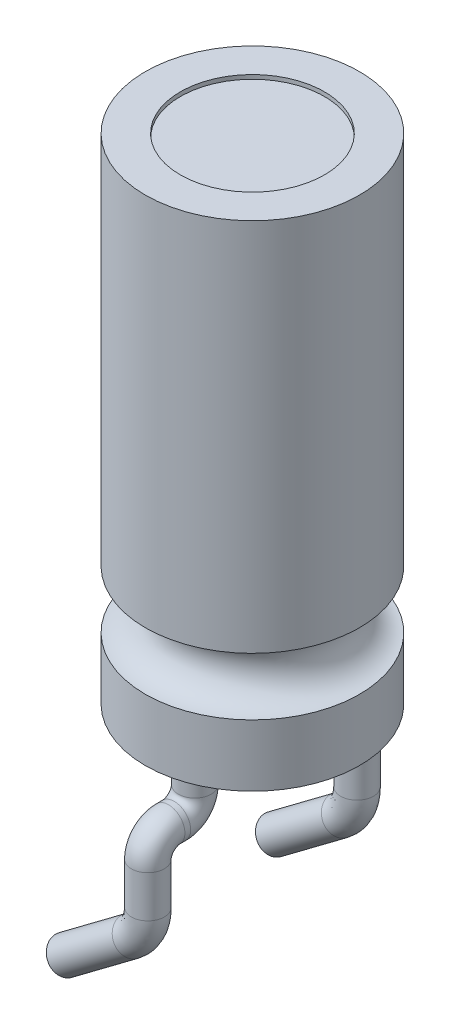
ISO-10303-21;
HEADER;
FILE_DESCRIPTION(('STEP AP214'),'2;1');
FILE_NAME('part.step','',(''),(''),'','','');
FILE_SCHEMA(('AUTOMOTIVE_DESIGN { 1 0 10303 214 1 1 1 1 }'));
ENDSEC;
DATA;
#1=APPLICATION_CONTEXT('core data for automotive mechanical design processes');
#2=APPLICATION_PROTOCOL_DEFINITION('international standard','automotive_design',2000,#1);
#3=PRODUCT_CONTEXT('',#1,'mechanical');
#4=PRODUCT('Part','Part','',(#3));
#5=PRODUCT_RELATED_PRODUCT_CATEGORY('part','',(#4));
#6=PRODUCT_DEFINITION_FORMATION('','',#4);
#7=PRODUCT_DEFINITION_CONTEXT('part definition',#1,'design');
#8=PRODUCT_DEFINITION('design','',#6,#7);
#9=PRODUCT_DEFINITION_SHAPE('','',#8);
#10=(LENGTH_UNIT() NAMED_UNIT(*) SI_UNIT(.MILLI.,.METRE.));
#11=(NAMED_UNIT(*) PLANE_ANGLE_UNIT() SI_UNIT($,.RADIAN.));
#12=(NAMED_UNIT(*) SI_UNIT($,.STERADIAN.) SOLID_ANGLE_UNIT());
#13=UNCERTAINTY_MEASURE_WITH_UNIT(LENGTH_MEASURE(1.E-05),#10,'distance_accuracy_value','');
#14=(GEOMETRIC_REPRESENTATION_CONTEXT(3) GLOBAL_UNCERTAINTY_ASSIGNED_CONTEXT((#13)) GLOBAL_UNIT_ASSIGNED_CONTEXT((#10,
#11,#12)) REPRESENTATION_CONTEXT('',''));
#15=CARTESIAN_POINT('',(0.,0.,0.));
#16=DIRECTION('',(0.,0.,1.));
#17=DIRECTION('',(1.,0.,0.));
#18=AXIS2_PLACEMENT_3D('',#15,#16,#17);
#19=CARTESIAN_POINT('',(2.6,27.5164236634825,0.));
#20=DIRECTION('',(0.,1.,0.));
#21=DIRECTION('',(0.,0.,1.));
#22=AXIS2_PLACEMENT_3D('',#19,#20,#21);
#23=PLANE('',#22);
#24=CARTESIAN_POINT('',(0.,27.5164236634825,-1.4));
#25=DIRECTION('',(0.,1.,0.));
#26=DIRECTION('',(0.,0.,1.));
#27=AXIS2_PLACEMENT_3D('',#24,#25,#26);
#28=CIRCLE('',#27,0.4);
#29=CARTESIAN_POINT('',(0.,27.5164236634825,-1.));
#30=VERTEX_POINT('',#29);
#31=EDGE_CURVE('E137',#30,#30,#28,.T.);
#32=ORIENTED_EDGE('',*,*,#31,.T.);
#33=EDGE_LOOP('',(#32));
#34=FACE_BOUND('',#33,.T.);
#35=CARTESIAN_POINT('',(0.,27.5164236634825,0.));
#36=DIRECTION('',(0.,1.,0.));
#37=DIRECTION('',(0.,0.,1.));
#38=AXIS2_PLACEMENT_3D('',#35,#36,#37);
#39=CIRCLE('',#38,2.6);
#40=CARTESIAN_POINT('',(0.,27.5164236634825,2.6));
#41=VERTEX_POINT('',#40);
#42=EDGE_CURVE('E36',#41,#41,#39,.T.);
#43=ORIENTED_EDGE('',*,*,#42,.F.);
#44=EDGE_LOOP('',(#43));
#45=FACE_BOUND('',#44,.T.);
#46=CARTESIAN_POINT('',(0.,27.5164236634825,1.4));
#47=DIRECTION('',(0.,1.,0.));
#48=DIRECTION('',(0.,0.,1.));
#49=AXIS2_PLACEMENT_3D('',#46,#47,#48);
#50=CIRCLE('',#49,0.4);
#51=CARTESIAN_POINT('',(0.,27.5164236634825,1.8));
#52=VERTEX_POINT('',#51);
#53=EDGE_CURVE('E10',#52,#52,#50,.F.);
#54=ORIENTED_EDGE('',*,*,#53,.F.);
#55=EDGE_LOOP('',(#54));
#56=FACE_BOUND('',#55,.T.);
#57=ADVANCED_FACE('F30',(#34,#45,#56),#23,.F.);
#58=CARTESIAN_POINT('',(0.,48.4017094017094,0.));
#59=DIRECTION('',(0.,1.,0.));
#60=DIRECTION('',(0.,0.,1.));
#61=AXIS2_PLACEMENT_3D('',#58,#59,#60);
#62=CYLINDRICAL_SURFACE('',#61,2.6);
#63=CARTESIAN_POINT('',(0.,29.0164236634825,0.));
#64=DIRECTION('',(0.,1.,0.));
#65=DIRECTION('',(0.,0.,1.));
#66=AXIS2_PLACEMENT_3D('',#63,#64,#65);
#67=CIRCLE('',#66,2.6);
#68=CARTESIAN_POINT('',(0.,29.0164236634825,2.6));
#69=VERTEX_POINT('',#68);
#70=EDGE_CURVE('E40',#69,#69,#67,.T.);
#71=ORIENTED_EDGE('',*,*,#70,.F.);
#72=EDGE_LOOP('',(#71));
#73=FACE_BOUND('',#72,.T.);
#74=ORIENTED_EDGE('',*,*,#42,.T.);
#75=EDGE_LOOP('',(#74));
#76=FACE_BOUND('',#75,.T.);
#77=ADVANCED_FACE('F122',(#73,#76),#62,.T.);
#78=CARTESIAN_POINT('',(0.,29.7164236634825,0.));
#79=DIRECTION('',(0.,1.,0.));
#80=DIRECTION('',(0.,0.,1.));
#81=AXIS2_PLACEMENT_3D('',#78,#79,#80);
#82=TOROIDAL_SURFACE('',#81,2.6,0.699999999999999);
#83=CARTESIAN_POINT('',(0.,30.4164236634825,0.));
#84=DIRECTION('',(0.,1.,0.));
#85=DIRECTION('',(0.,0.,1.));
#86=AXIS2_PLACEMENT_3D('',#83,#84,#85);
#87=CIRCLE('',#86,2.6);
#88=CARTESIAN_POINT('',(0.,30.4164236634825,2.6));
#89=VERTEX_POINT('',#88);
#90=EDGE_CURVE('E44',#89,#89,#87,.T.);
#91=ORIENTED_EDGE('',*,*,#90,.F.);
#92=EDGE_LOOP('',(#91));
#93=FACE_BOUND('',#92,.T.);
#94=ORIENTED_EDGE('',*,*,#70,.T.);
#95=EDGE_LOOP('',(#94));
#96=FACE_BOUND('',#95,.T.);
#97=ADVANCED_FACE('F119',(#93,#96),#82,.F.);
#98=CARTESIAN_POINT('',(0.,48.4017094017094,0.));
#99=DIRECTION('',(0.,1.,0.));
#100=DIRECTION('',(0.,0.,1.));
#101=AXIS2_PLACEMENT_3D('',#98,#99,#100);
#102=CYLINDRICAL_SURFACE('',#101,2.6);
#103=CARTESIAN_POINT('',(0.,39.5164236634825,0.));
#104=DIRECTION('',(0.,1.,0.));
#105=DIRECTION('',(0.,0.,1.));
#106=AXIS2_PLACEMENT_3D('',#103,#104,#105);
#107=CIRCLE('',#106,2.6);
#108=CARTESIAN_POINT('',(0.,39.5164236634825,2.6));
#109=VERTEX_POINT('',#108);
#110=EDGE_CURVE('E49',#109,#109,#107,.T.);
#111=ORIENTED_EDGE('',*,*,#110,.F.);
#112=EDGE_LOOP('',(#111));
#113=FACE_BOUND('',#112,.T.);
#114=ORIENTED_EDGE('',*,*,#90,.T.);
#115=EDGE_LOOP('',(#114));
#116=FACE_BOUND('',#115,.T.);
#117=ADVANCED_FACE('F115',(#113,#116),#102,.T.);
#118=CARTESIAN_POINT('',(0.,39.5164236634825,0.));
#119=DIRECTION('',(0.,-1.,0.));
#120=DIRECTION('',(0.,0.,-1.));
#121=AXIS2_PLACEMENT_3D('',#118,#119,#120);
#122=PLANE('',#121);
#123=CARTESIAN_POINT('',(0.,39.5164236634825,0.));
#124=DIRECTION('',(0.,1.,0.));
#125=DIRECTION('',(0.,0.,1.));
#126=AXIS2_PLACEMENT_3D('',#123,#124,#125);
#127=CIRCLE('',#126,1.75);
#128=CARTESIAN_POINT('',(0.,39.5164236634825,1.75));
#129=VERTEX_POINT('',#128);
#130=EDGE_CURVE('E55',#129,#129,#127,.T.);
#131=ORIENTED_EDGE('',*,*,#130,.F.);
#132=EDGE_LOOP('',(#131));
#133=FACE_BOUND('',#132,.T.);
#134=ORIENTED_EDGE('',*,*,#110,.T.);
#135=EDGE_LOOP('',(#134));
#136=FACE_BOUND('',#135,.T.);
#137=ADVANCED_FACE('F111',(#133,#136),#122,.F.);
#138=CARTESIAN_POINT('',(0.,39.4164236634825,0.));
#139=DIRECTION('',(0.,1.,0.));
#140=DIRECTION('',(0.,0.,1.));
#141=AXIS2_PLACEMENT_3D('',#138,#139,#140);
#142=CYLINDRICAL_SURFACE('',#141,1.75);
#143=CARTESIAN_POINT('',(0.,39.4164236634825,0.));
#144=DIRECTION('',(0.,1.,0.));
#145=DIRECTION('',(0.,0.,1.));
#146=AXIS2_PLACEMENT_3D('',#143,#144,#145);
#147=CIRCLE('',#146,1.75);
#148=CARTESIAN_POINT('',(0.,39.4164236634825,1.75));
#149=VERTEX_POINT('',#148);
#150=EDGE_CURVE('E52',#149,#149,#147,.T.);
#151=ORIENTED_EDGE('',*,*,#150,.F.);
#152=EDGE_LOOP('',(#151));
#153=FACE_BOUND('',#152,.T.);
#154=ORIENTED_EDGE('',*,*,#130,.T.);
#155=EDGE_LOOP('',(#154));
#156=FACE_BOUND('',#155,.T.);
#157=ADVANCED_FACE('F107',(#153,#156),#142,.F.);
#158=CARTESIAN_POINT('',(0.,39.4164236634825,0.));
#159=DIRECTION('',(0.,1.,0.));
#160=DIRECTION('',(0.,0.,1.));
#161=AXIS2_PLACEMENT_3D('',#158,#159,#160);
#162=PLANE('',#161);
#163=ORIENTED_EDGE('',*,*,#150,.T.);
#164=EDGE_LOOP('',(#163));
#165=FACE_BOUND('',#164,.T.);
#166=ADVANCED_FACE('F103',(#165),#162,.T.);
#167=CARTESIAN_POINT('',(0.,25.5164236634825,2.04));
#168=DIRECTION('',(1.,0.,0.));
#169=DIRECTION('',(0.,0.,-1.));
#170=AXIS2_PLACEMENT_3D('',#167,#168,#169);
#171=TOROIDAL_SURFACE('',#170,0.500000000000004,0.4);
#172=CARTESIAN_POINT('',(0.,26.0164236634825,2.04));
#173=DIRECTION('',(0.,0.,1.));
#174=DIRECTION('',(0.,-1.,0.));
#175=AXIS2_PLACEMENT_3D('',#172,#173,#174);
#176=CIRCLE('',#175,0.4);
#177=CARTESIAN_POINT('',(0.,26.4164236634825,2.03999999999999));
#178=VERTEX_POINT('',#177);
#179=EDGE_CURVE('E61',#178,#178,#176,.T.);
#180=CARTESIAN_POINT('',(0.,25.5164236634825,2.54));
#181=DIRECTION('',(0.,-1.,0.));
#182=DIRECTION('',(0.,0.,-1.));
#183=AXIS2_PLACEMENT_3D('',#180,#181,#182);
#184=CIRCLE('',#183,0.4);
#185=CARTESIAN_POINT('',(0.,25.5164236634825,2.94));
#186=VERTEX_POINT('',#185);
#187=EDGE_CURVE('E58',#186,#186,#184,.T.);
#188=CARTESIAN_POINT('',(0.,25.5164236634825,2.04));
#189=DIRECTION('',(1.,0.,0.));
#190=DIRECTION('',(0.,0.,-1.));
#191=AXIS2_PLACEMENT_3D('',#188,#189,#190);
#192=CIRCLE('',#191,0.900000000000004);
#193=EDGE_CURVE('',#178,#186,#192,.T.);
#194=ORIENTED_EDGE('',*,*,#179,.T.);
#195=ORIENTED_EDGE('',*,*,#187,.F.);
#196=ORIENTED_EDGE('',*,*,#193,.T.);
#197=ORIENTED_EDGE('',*,*,#193,.F.);
#198=EDGE_LOOP('',(#194,#196,#195,#197));
#199=FACE_BOUND('',#198,.T.);
#200=ADVANCED_FACE('F99',(#199),#171,.T.);
#201=CARTESIAN_POINT('',(0.,26.0164236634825,1.9));
#202=DIRECTION('',(0.,0.,1.));
#203=DIRECTION('',(1.,0.,0.));
#204=AXIS2_PLACEMENT_3D('',#201,#202,#203);
#205=CYLINDRICAL_SURFACE('',#204,0.4);
#206=CARTESIAN_POINT('',(0.,26.0164236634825,1.9));
#207=DIRECTION('',(0.,0.,1.));
#208=DIRECTION('',(0.,-1.,0.));
#209=AXIS2_PLACEMENT_3D('',#206,#207,#208);
#210=CIRCLE('',#209,0.4);
#211=CARTESIAN_POINT('',(0.,25.6164236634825,1.9));
#212=VERTEX_POINT('',#211);
#213=EDGE_CURVE('E64',#212,#212,#210,.T.);
#214=ORIENTED_EDGE('',*,*,#213,.T.);
#215=EDGE_LOOP('',(#214));
#216=FACE_BOUND('',#215,.T.);
#217=ORIENTED_EDGE('',*,*,#179,.F.);
#218=EDGE_LOOP('',(#217));
#219=FACE_BOUND('',#218,.T.);
#220=ADVANCED_FACE('F95',(#216,#219),#205,.T.);
#221=CARTESIAN_POINT('',(0.,26.5164236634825,1.9));
#222=DIRECTION('',(-1.,0.,0.));
#223=DIRECTION('',(0.,0.,1.));
#224=AXIS2_PLACEMENT_3D('',#221,#222,#223);
#225=TOROIDAL_SURFACE('',#224,0.5,0.4);
#226=CARTESIAN_POINT('',(0.,26.5164236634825,1.4));
#227=DIRECTION('',(0.,-1.,0.));
#228=DIRECTION('',(0.,0.,-1.));
#229=AXIS2_PLACEMENT_3D('',#226,#227,#228);
#230=CIRCLE('',#229,0.4);
#231=CARTESIAN_POINT('',(0.,26.5164236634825,1.));
#232=VERTEX_POINT('',#231);
#233=EDGE_CURVE('E67',#232,#232,#230,.T.);
#234=CARTESIAN_POINT('',(0.,26.5164236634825,1.9));
#235=DIRECTION('',(-1.,0.,0.));
#236=DIRECTION('',(0.,0.,1.));
#237=AXIS2_PLACEMENT_3D('',#234,#235,#236);
#238=CIRCLE('',#237,0.9);
#239=EDGE_CURVE('',#232,#212,#238,.T.);
#240=ORIENTED_EDGE('',*,*,#233,.T.);
#241=ORIENTED_EDGE('',*,*,#213,.F.);
#242=ORIENTED_EDGE('',*,*,#239,.T.);
#243=ORIENTED_EDGE('',*,*,#239,.F.);
#244=EDGE_LOOP('',(#240,#242,#241,#243));
#245=FACE_BOUND('',#244,.T.);
#246=ADVANCED_FACE('F91',(#245),#225,.T.);
#247=CARTESIAN_POINT('',(0.,26.5164236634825,1.4));
#248=DIRECTION('',(0.,1.,0.));
#249=DIRECTION('',(0.,0.,1.));
#250=AXIS2_PLACEMENT_3D('',#247,#248,#249);
#251=CYLINDRICAL_SURFACE('',#250,0.4);
#252=ORIENTED_EDGE('',*,*,#233,.F.);
#253=EDGE_LOOP('',(#252));
#254=FACE_BOUND('',#253,.T.);
#255=ORIENTED_EDGE('',*,*,#53,.T.);
#256=EDGE_LOOP('',(#255));
#257=FACE_BOUND('',#256,.T.);
#258=ADVANCED_FACE('F86',(#254,#257),#251,.T.);
#259=CARTESIAN_POINT('',(-0.399678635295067,23.7028784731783,2.54));
#260=DIRECTION('',(-0.800531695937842,-0.599290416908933,0.));
#261=DIRECTION('',(0.,0.,-1.));
#262=AXIS2_PLACEMENT_3D('',#259,#260,#261);
#263=CIRCLE('',#262,0.4);
#264=DIRECTION('',(-0.800190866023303,-0.599745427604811,0.));
#265=VECTOR('',#264,1.);
#266=SURFACE_OF_LINEAR_EXTRUSION('',#263,#265);
#267=CARTESIAN_POINT('',(-0.399678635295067,23.7028784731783,2.14));
#268=VERTEX_POINT('',#267);
#269=EDGE_CURVE('E73',#268,#268,#263,.T.);
#270=ORIENTED_EDGE('',*,*,#269,.T.);
#271=EDGE_LOOP('',(#270));
#272=FACE_BOUND('',#271,.T.);
#273=CARTESIAN_POINT('',(-2.00006036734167,22.5033876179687,2.54));
#274=DIRECTION('',(-0.800531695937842,-0.599290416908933,0.));
#275=DIRECTION('',(0.,0.,-1.));
#276=AXIS2_PLACEMENT_3D('',#273,#274,#275);
#277=CIRCLE('',#276,0.4);
#278=CARTESIAN_POINT('',(-2.00006036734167,22.5033876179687,2.14));
#279=VERTEX_POINT('',#278);
#280=EDGE_CURVE('E70',#279,#279,#277,.T.);
#281=ORIENTED_EDGE('',*,*,#280,.F.);
#282=EDGE_LOOP('',(#281));
#283=FACE_BOUND('',#282,.T.);
#284=ADVANCED_FACE('F81',(#272,#283),#266,.T.);
#285=CARTESIAN_POINT('',(0.000575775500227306,24.5036378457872,2.54));
#286=DIRECTION('',(0.,-1.,0.));
#287=DIRECTION('',(0.,0.,-1.));
#288=AXIS2_PLACEMENT_3D('',#285,#286,#287);
#289=CIRCLE('',#288,0.4);
#290=CARTESIAN_POINT('',(-0.999424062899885,24.5030693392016,2.54));
#291=DIRECTION('',(0.,0.,-1.));
#292=AXIS1_PLACEMENT('',#290,#291);
#293=SURFACE_OF_REVOLUTION('',#289,#292);
#294=CARTESIAN_POINT('',(0.000575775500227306,24.5036378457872,2.14));
#295=VERTEX_POINT('',#294);
#296=EDGE_CURVE('E77',#295,#295,#289,.T.);
#297=ORIENTED_EDGE('',*,*,#296,.T.);
#298=EDGE_LOOP('',(#297));
#299=FACE_BOUND('',#298,.T.);
#300=ORIENTED_EDGE('',*,*,#269,.F.);
#301=EDGE_LOOP('',(#300));
#302=FACE_BOUND('',#301,.T.);
#303=ADVANCED_FACE('F85',(#299,#302),#293,.F.);
#304=DIRECTION('',(-0.000568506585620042,0.999999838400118,0.));
#305=VECTOR('',#304,1.);
#306=SURFACE_OF_LINEAR_EXTRUSION('',#289,#305);
#307=ORIENTED_EDGE('',*,*,#296,.F.);
#308=EDGE_LOOP('',(#307));
#309=FACE_BOUND('',#308,.T.);
#310=ORIENTED_EDGE('',*,*,#187,.T.);
#311=EDGE_LOOP('',(#310));
#312=FACE_BOUND('',#311,.T.);
#313=ADVANCED_FACE('F161',(#309,#312),#306,.F.);
#314=CARTESIAN_POINT('',(-2.00006036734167,22.5033876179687,2.54));
#315=DIRECTION('',(-0.800531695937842,-0.599290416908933,0.));
#316=DIRECTION('',(0.,0.,-1.));
#317=AXIS2_PLACEMENT_3D('',#314,#315,#316);
#318=PLANE('',#317);
#319=ORIENTED_EDGE('',*,*,#280,.T.);
#320=EDGE_LOOP('',(#319));
#321=FACE_BOUND('',#320,.T.);
#322=ADVANCED_FACE('F164',(#321),#318,.T.);
#323=CARTESIAN_POINT('',(0.,25.5164236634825,-2.04));
#324=DIRECTION('',(-1.,0.,0.));
#325=DIRECTION('',(0.,0.,1.));
#326=AXIS2_PLACEMENT_3D('',#323,#324,#325);
#327=TOROIDAL_SURFACE('',#326,0.500000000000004,0.4);
#328=CARTESIAN_POINT('',(0.,26.0164236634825,-2.04));
#329=DIRECTION('',(0.,0.,1.));
#330=DIRECTION('',(0.,-1.,0.));
#331=AXIS2_PLACEMENT_3D('',#328,#329,#330);
#332=CIRCLE('',#331,0.4);
#333=CARTESIAN_POINT('',(0.,26.4164236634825,-2.03999999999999));
#334=VERTEX_POINT('',#333);
#335=EDGE_CURVE('E152',#334,#334,#332,.T.);
#336=CARTESIAN_POINT('',(0.,25.5164236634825,-2.54));
#337=DIRECTION('',(0.,1.,0.));
#338=DIRECTION('',(0.,0.,1.));
#339=AXIS2_PLACEMENT_3D('',#336,#337,#338);
#340=CIRCLE('',#339,0.4);
#341=CARTESIAN_POINT('',(0.,25.5164236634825,-2.94));
#342=VERTEX_POINT('',#341);
#343=EDGE_CURVE('E203',#342,#342,#340,.T.);
#344=CARTESIAN_POINT('',(0.,25.5164236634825,-2.04));
#345=DIRECTION('',(-1.,0.,0.));
#346=DIRECTION('',(0.,0.,1.));
#347=AXIS2_PLACEMENT_3D('',#344,#345,#346);
#348=CIRCLE('',#347,0.900000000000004);
#349=EDGE_CURVE('',#334,#342,#348,.T.);
#350=ORIENTED_EDGE('',*,*,#335,.F.);
#351=ORIENTED_EDGE('',*,*,#343,.T.);
#352=ORIENTED_EDGE('',*,*,#349,.T.);
#353=ORIENTED_EDGE('',*,*,#349,.F.);
#354=EDGE_LOOP('',(#350,#352,#351,#353));
#355=FACE_BOUND('',#354,.T.);
#356=ADVANCED_FACE('F171',(#355),#327,.T.);
#357=CARTESIAN_POINT('',(0.,26.0164236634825,-1.9));
#358=DIRECTION('',(0.,0.,-1.));
#359=DIRECTION('',(-1.,0.,0.));
#360=AXIS2_PLACEMENT_3D('',#357,#358,#359);
#361=CYLINDRICAL_SURFACE('',#360,0.4);
#362=CARTESIAN_POINT('',(0.,26.0164236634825,-1.9));
#363=DIRECTION('',(0.,0.,1.));
#364=DIRECTION('',(0.,-1.,0.));
#365=AXIS2_PLACEMENT_3D('',#362,#363,#364);
#366=CIRCLE('',#365,0.4);
#367=CARTESIAN_POINT('',(0.,25.6164236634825,-1.9));
#368=VERTEX_POINT('',#367);
#369=EDGE_CURVE('E144',#368,#368,#366,.T.);
#370=ORIENTED_EDGE('',*,*,#369,.F.);
#371=EDGE_LOOP('',(#370));
#372=FACE_BOUND('',#371,.T.);
#373=ORIENTED_EDGE('',*,*,#335,.T.);
#374=EDGE_LOOP('',(#373));
#375=FACE_BOUND('',#374,.T.);
#376=ADVANCED_FACE('F177',(#372,#375),#361,.T.);
#377=CARTESIAN_POINT('',(0.,26.5164236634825,-1.9));
#378=DIRECTION('',(1.,0.,0.));
#379=DIRECTION('',(0.,0.,-1.));
#380=AXIS2_PLACEMENT_3D('',#377,#378,#379);
#381=TOROIDAL_SURFACE('',#380,0.5,0.4);
#382=CARTESIAN_POINT('',(0.,26.5164236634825,-1.4));
#383=DIRECTION('',(0.,1.,0.));
#384=DIRECTION('',(0.,0.,1.));
#385=AXIS2_PLACEMENT_3D('',#382,#383,#384);
#386=CIRCLE('',#385,0.4);
#387=CARTESIAN_POINT('',(0.,26.5164236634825,-1.));
#388=VERTEX_POINT('',#387);
#389=EDGE_CURVE('E140',#388,#388,#386,.T.);
#390=CARTESIAN_POINT('',(0.,26.5164236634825,-1.9));
#391=DIRECTION('',(1.,0.,0.));
#392=DIRECTION('',(0.,0.,-1.));
#393=AXIS2_PLACEMENT_3D('',#390,#391,#392);
#394=CIRCLE('',#393,0.9);
#395=EDGE_CURVE('',#388,#368,#394,.T.);
#396=ORIENTED_EDGE('',*,*,#389,.F.);
#397=ORIENTED_EDGE('',*,*,#369,.T.);
#398=ORIENTED_EDGE('',*,*,#395,.T.);
#399=ORIENTED_EDGE('',*,*,#395,.F.);
#400=EDGE_LOOP('',(#396,#398,#397,#399));
#401=FACE_BOUND('',#400,.T.);
#402=ADVANCED_FACE('F181',(#401),#381,.T.);
#403=CARTESIAN_POINT('',(0.,26.5164236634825,-1.4));
#404=DIRECTION('',(0.,1.,0.));
#405=DIRECTION('',(0.,0.,1.));
#406=AXIS2_PLACEMENT_3D('',#403,#404,#405);
#407=CYLINDRICAL_SURFACE('',#406,0.4);
#408=ORIENTED_EDGE('',*,*,#389,.T.);
#409=EDGE_LOOP('',(#408));
#410=FACE_BOUND('',#409,.T.);
#411=ORIENTED_EDGE('',*,*,#31,.F.);
#412=EDGE_LOOP('',(#411));
#413=FACE_BOUND('',#412,.T.);
#414=ADVANCED_FACE('F185',(#410,#413),#407,.T.);
#415=CARTESIAN_POINT('',(-0.399678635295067,23.7028784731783,-2.54));
#416=DIRECTION('',(0.800531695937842,0.599290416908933,0.));
#417=DIRECTION('',(0.,0.,1.));
#418=AXIS2_PLACEMENT_3D('',#415,#416,#417);
#419=CIRCLE('',#418,0.4);
#420=DIRECTION('',(-0.800190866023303,-0.599745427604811,0.));
#421=VECTOR('',#420,1.);
#422=SURFACE_OF_LINEAR_EXTRUSION('',#419,#421);
#423=CARTESIAN_POINT('',(-0.399678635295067,23.7028784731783,-2.14));
#424=VERTEX_POINT('',#423);
#425=EDGE_CURVE('E147',#424,#424,#419,.T.);
#426=ORIENTED_EDGE('',*,*,#425,.F.);
#427=EDGE_LOOP('',(#426));
#428=FACE_BOUND('',#427,.T.);
#429=CARTESIAN_POINT('',(-2.00006036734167,22.5033876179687,-2.54));
#430=DIRECTION('',(0.800531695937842,0.599290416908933,0.));
#431=DIRECTION('',(0.,0.,1.));
#432=AXIS2_PLACEMENT_3D('',#429,#430,#431);
#433=CIRCLE('',#432,0.4);
#434=CARTESIAN_POINT('',(-2.00006036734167,22.5033876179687,-2.14));
#435=VERTEX_POINT('',#434);
#436=EDGE_CURVE('E141',#435,#435,#433,.T.);
#437=ORIENTED_EDGE('',*,*,#436,.T.);
#438=EDGE_LOOP('',(#437));
#439=FACE_BOUND('',#438,.T.);
#440=ADVANCED_FACE('F189',(#428,#439),#422,.F.);
#441=CARTESIAN_POINT('',(0.000575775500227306,24.5036378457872,-2.54));
#442=DIRECTION('',(0.,1.,0.));
#443=DIRECTION('',(0.,0.,1.));
#444=AXIS2_PLACEMENT_3D('',#441,#442,#443);
#445=CIRCLE('',#444,0.4);
#446=CARTESIAN_POINT('',(-0.999424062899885,24.5030693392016,-2.54));
#447=DIRECTION('',(0.,0.,-1.));
#448=AXIS1_PLACEMENT('',#446,#447);
#449=SURFACE_OF_REVOLUTION('',#445,#448);
#450=CARTESIAN_POINT('',(0.000575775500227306,24.5036378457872,-2.14));
#451=VERTEX_POINT('',#450);
#452=EDGE_CURVE('E199',#451,#451,#445,.T.);
#453=ORIENTED_EDGE('',*,*,#452,.F.);
#454=EDGE_LOOP('',(#453));
#455=FACE_BOUND('',#454,.T.);
#456=ORIENTED_EDGE('',*,*,#425,.T.);
#457=EDGE_LOOP('',(#456));
#458=FACE_BOUND('',#457,.T.);
#459=ADVANCED_FACE('F193',(#455,#458),#449,.T.);
#460=DIRECTION('',(-0.000568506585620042,0.999999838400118,0.));
#461=VECTOR('',#460,1.);
#462=SURFACE_OF_LINEAR_EXTRUSION('',#445,#461);
#463=ORIENTED_EDGE('',*,*,#452,.T.);
#464=EDGE_LOOP('',(#463));
#465=FACE_BOUND('',#464,.T.);
#466=ORIENTED_EDGE('',*,*,#343,.F.);
#467=EDGE_LOOP('',(#466));
#468=FACE_BOUND('',#467,.T.);
#469=ADVANCED_FACE('F205',(#465,#468),#462,.T.);
#470=CARTESIAN_POINT('',(-2.00006036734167,22.5033876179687,-2.54));
#471=DIRECTION('',(-0.800531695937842,-0.599290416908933,0.));
#472=DIRECTION('',(0.,0.,1.));
#473=AXIS2_PLACEMENT_3D('',#470,#471,#472);
#474=PLANE('',#473);
#475=ORIENTED_EDGE('',*,*,#436,.F.);
#476=EDGE_LOOP('',(#475));
#477=FACE_BOUND('',#476,.T.);
#478=ADVANCED_FACE('F208',(#477),#474,.T.);
#479=CLOSED_SHELL('',(#57,#77,#97,#117,#137,#157,#166,#200,#220,#246,#258,#284,#303,#313,#322,
#356,#376,#402,#414,#440,#459,#469,#478));
#480=MANIFOLD_SOLID_BREP('B2',#479);
#481=ADVANCED_BREP_SHAPE_REPRESENTATION('',(#18,#480),#14);
#482=SHAPE_DEFINITION_REPRESENTATION(#9,#481);
ENDSEC;
END-ISO-10303-21;
